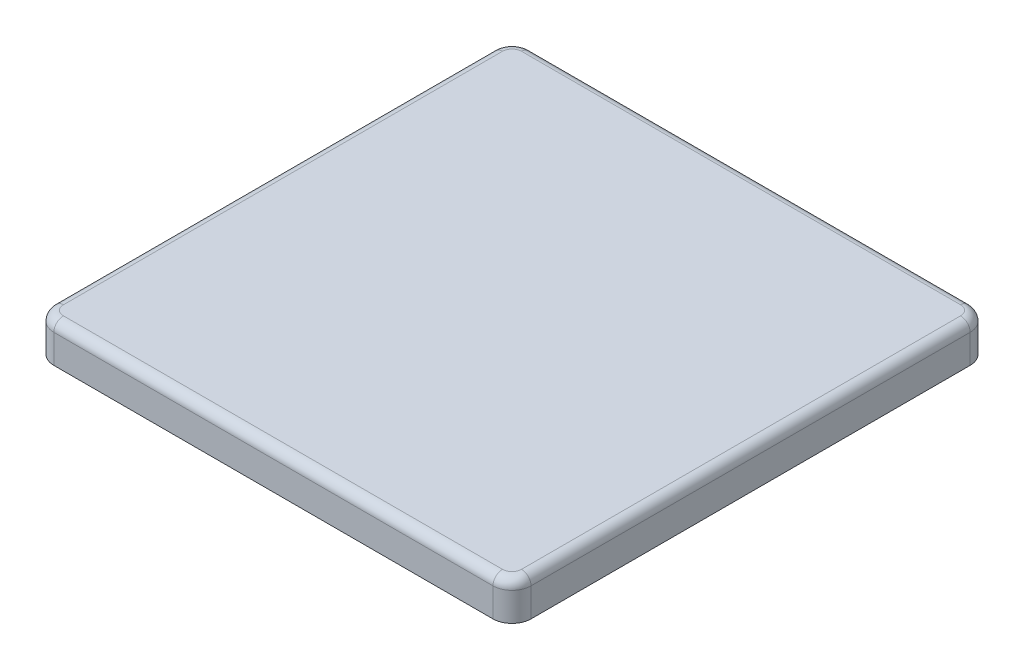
ISO-10303-21;
HEADER;
FILE_DESCRIPTION(('STEP AP214'),'2;1');
FILE_NAME('part.step','',(''),(''),'','','');
FILE_SCHEMA(('AUTOMOTIVE_DESIGN { 1 0 10303 214 1 1 1 1 }'));
ENDSEC;
DATA;
#1=APPLICATION_CONTEXT('core data for automotive mechanical design processes');
#2=APPLICATION_PROTOCOL_DEFINITION('international standard','automotive_design',2000,#1);
#3=PRODUCT_CONTEXT('',#1,'mechanical');
#4=PRODUCT('Part','Part','',(#3));
#5=PRODUCT_RELATED_PRODUCT_CATEGORY('part','',(#4));
#6=PRODUCT_DEFINITION_FORMATION('','',#4);
#7=PRODUCT_DEFINITION_CONTEXT('part definition',#1,'design');
#8=PRODUCT_DEFINITION('design','',#6,#7);
#9=PRODUCT_DEFINITION_SHAPE('','',#8);
#10=(LENGTH_UNIT() NAMED_UNIT(*) SI_UNIT(.MILLI.,.METRE.));
#11=(NAMED_UNIT(*) PLANE_ANGLE_UNIT() SI_UNIT($,.RADIAN.));
#12=(NAMED_UNIT(*) SI_UNIT($,.STERADIAN.) SOLID_ANGLE_UNIT());
#13=UNCERTAINTY_MEASURE_WITH_UNIT(LENGTH_MEASURE(1.E-05),#10,'distance_accuracy_value','');
#14=(GEOMETRIC_REPRESENTATION_CONTEXT(3) GLOBAL_UNCERTAINTY_ASSIGNED_CONTEXT((#13)) GLOBAL_UNIT_ASSIGNED_CONTEXT((#10,
#11,#12)) REPRESENTATION_CONTEXT('',''));
#15=CARTESIAN_POINT('',(0.,0.,0.));
#16=DIRECTION('',(0.,0.,1.));
#17=DIRECTION('',(1.,0.,0.));
#18=AXIS2_PLACEMENT_3D('',#15,#16,#17);
#19=CARTESIAN_POINT('',(-22.2,0.,22.2));
#20=DIRECTION('',(0.,-1.,0.));
#21=DIRECTION('',(0.,0.,-1.));
#22=AXIS2_PLACEMENT_3D('',#19,#20,#21);
#23=PLANE('',#22);
#24=DIRECTION('',(0.,0.,1.));
#25=VECTOR('',#24,1.);
#26=CARTESIAN_POINT('',(-21.2,0.,4.));
#27=LINE('',#26,#25);
#28=CARTESIAN_POINT('',(-21.2,0.,-4.));
#29=VERTEX_POINT('',#28);
#30=CARTESIAN_POINT('',(-21.2,0.,4.));
#31=VERTEX_POINT('',#30);
#32=EDGE_CURVE('E281',#29,#31,#27,.T.);
#33=ORIENTED_EDGE('',*,*,#32,.F.);
#34=DIRECTION('',(1.,0.,0.));
#35=VECTOR('',#34,1.);
#36=CARTESIAN_POINT('',(-23.,0.,-4.));
#37=LINE('',#36,#35);
#38=CARTESIAN_POINT('',(-23.,0.,-4.));
#39=VERTEX_POINT('',#38);
#40=EDGE_CURVE('E246',#39,#29,#37,.T.);
#41=ORIENTED_EDGE('',*,*,#40,.F.);
#42=DIRECTION('',(0.,0.,-1.));
#43=VECTOR('',#42,1.);
#44=CARTESIAN_POINT('',(-23.,0.,22.2));
#45=LINE('',#44,#43);
#46=CARTESIAN_POINT('',(-23.,0.,-22.2));
#47=VERTEX_POINT('',#46);
#48=EDGE_CURVE('E303',#39,#47,#45,.T.);
#49=ORIENTED_EDGE('',*,*,#48,.T.);
#50=CARTESIAN_POINT('',(-22.2,0.,-22.2));
#51=DIRECTION('',(0.,-1.,0.));
#52=DIRECTION('',(0.,0.,-1.));
#53=AXIS2_PLACEMENT_3D('',#50,#51,#52);
#54=CIRCLE('',#53,0.799999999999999);
#55=CARTESIAN_POINT('',(-22.2,0.,-23.));
#56=VERTEX_POINT('',#55);
#57=EDGE_CURVE('E308',#47,#56,#54,.T.);
#58=ORIENTED_EDGE('',*,*,#57,.T.);
#59=DIRECTION('',(1.,0.,0.));
#60=VECTOR('',#59,1.);
#61=CARTESIAN_POINT('',(-22.2,0.,-23.));
#62=LINE('',#61,#60);
#63=CARTESIAN_POINT('',(22.2,0.,-23.));
#64=VERTEX_POINT('',#63);
#65=EDGE_CURVE('E311',#56,#64,#62,.T.);
#66=ORIENTED_EDGE('',*,*,#65,.T.);
#67=CARTESIAN_POINT('',(22.2,0.,-22.2));
#68=DIRECTION('',(0.,-1.,0.));
#69=DIRECTION('',(0.,0.,-1.));
#70=AXIS2_PLACEMENT_3D('',#67,#68,#69);
#71=CIRCLE('',#70,0.799999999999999);
#72=CARTESIAN_POINT('',(23.,0.,-22.2));
#73=VERTEX_POINT('',#72);
#74=EDGE_CURVE('E314',#64,#73,#71,.T.);
#75=ORIENTED_EDGE('',*,*,#74,.T.);
#76=DIRECTION('',(0.,0.,1.));
#77=VECTOR('',#76,1.);
#78=CARTESIAN_POINT('',(23.,0.,22.2));
#79=LINE('',#78,#77);
#80=CARTESIAN_POINT('',(23.,0.,22.2));
#81=VERTEX_POINT('',#80);
#82=EDGE_CURVE('E317',#73,#81,#79,.T.);
#83=ORIENTED_EDGE('',*,*,#82,.T.);
#84=CARTESIAN_POINT('',(22.2,0.,22.2));
#85=DIRECTION('',(0.,-1.,0.));
#86=DIRECTION('',(0.,0.,-1.));
#87=AXIS2_PLACEMENT_3D('',#84,#85,#86);
#88=CIRCLE('',#87,0.799999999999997);
#89=CARTESIAN_POINT('',(22.2,0.,23.));
#90=VERTEX_POINT('',#89);
#91=EDGE_CURVE('E320',#81,#90,#88,.T.);
#92=ORIENTED_EDGE('',*,*,#91,.T.);
#93=DIRECTION('',(-1.,0.,0.));
#94=VECTOR('',#93,1.);
#95=CARTESIAN_POINT('',(-22.2,0.,23.));
#96=LINE('',#95,#94);
#97=CARTESIAN_POINT('',(-22.2,0.,23.));
#98=VERTEX_POINT('',#97);
#99=EDGE_CURVE('E323',#90,#98,#96,.T.);
#100=ORIENTED_EDGE('',*,*,#99,.T.);
#101=CARTESIAN_POINT('',(-22.2,0.,22.2));
#102=DIRECTION('',(0.,-1.,0.));
#103=DIRECTION('',(0.,0.,-1.));
#104=AXIS2_PLACEMENT_3D('',#101,#102,#103);
#105=CIRCLE('',#104,0.8);
#106=CARTESIAN_POINT('',(-23.,0.,22.2));
#107=VERTEX_POINT('',#106);
#108=EDGE_CURVE('E300',#98,#107,#105,.T.);
#109=ORIENTED_EDGE('',*,*,#108,.T.);
#110=CARTESIAN_POINT('',(-23.,0.,4.));
#111=VERTEX_POINT('',#110);
#112=EDGE_CURVE('E305',#107,#111,#45,.T.);
#113=ORIENTED_EDGE('',*,*,#112,.T.);
#114=DIRECTION('',(-1.,0.,0.));
#115=VECTOR('',#114,1.);
#116=CARTESIAN_POINT('',(-23.,0.,4.));
#117=LINE('',#116,#115);
#118=EDGE_CURVE('E273',#31,#111,#117,.T.);
#119=ORIENTED_EDGE('',*,*,#118,.F.);
#120=EDGE_LOOP('',(#33,#41,#49,#58,#66,#75,#83,#92,#100,#109,#113,#119));
#121=FACE_BOUND('',#120,.T.);
#122=DIRECTION('',(0.707106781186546,0.,0.707106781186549));
#123=VECTOR('',#122,1.);
#124=CARTESIAN_POINT('',(0.707106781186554,0.,-3.7476659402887));
#125=LINE('',#124,#123);
#126=CARTESIAN_POINT('',(0.707106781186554,0.,-3.7476659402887));
#127=VERTEX_POINT('',#126);
#128=CARTESIAN_POINT('',(3.7476659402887,0.,-0.70710678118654));
#129=VERTEX_POINT('',#128);
#130=EDGE_CURVE('E242',#127,#129,#125,.T.);
#131=ORIENTED_EDGE('',*,*,#130,.F.);
#132=DIRECTION('',(0.707106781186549,0.,-0.707106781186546));
#133=VECTOR('',#132,1.);
#134=CARTESIAN_POINT('',(-3.7476659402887,0.,0.707106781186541));
#135=LINE('',#134,#133);
#136=CARTESIAN_POINT('',(-3.7476659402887,0.,0.707106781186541));
#137=VERTEX_POINT('',#136);
#138=EDGE_CURVE('E250',#137,#127,#135,.T.);
#139=ORIENTED_EDGE('',*,*,#138,.F.);
#140=DIRECTION('',(-0.707106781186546,0.,-0.707106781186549));
#141=VECTOR('',#140,1.);
#142=CARTESIAN_POINT('',(-3.7476659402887,0.,0.707106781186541));
#143=LINE('',#142,#141);
#144=CARTESIAN_POINT('',(-0.707106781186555,0.,3.7476659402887));
#145=VERTEX_POINT('',#144);
#146=EDGE_CURVE('E261',#145,#137,#143,.T.);
#147=ORIENTED_EDGE('',*,*,#146,.F.);
#148=DIRECTION('',(-0.707106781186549,0.,0.707106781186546));
#149=VECTOR('',#148,1.);
#150=CARTESIAN_POINT('',(-0.707106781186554,0.,3.7476659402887));
#151=LINE('',#150,#149);
#152=EDGE_CURVE('E259',#129,#145,#151,.T.);
#153=ORIENTED_EDGE('',*,*,#152,.F.);
#154=EDGE_LOOP('',(#131,#139,#147,#153));
#155=FACE_BOUND('',#154,.T.);
#156=ADVANCED_FACE('F36',(#121,#155),#23,.T.);
#157=CARTESIAN_POINT('',(-23.,0.,22.2));
#158=DIRECTION('',(-1.,0.,0.));
#159=DIRECTION('',(0.,0.,1.));
#160=AXIS2_PLACEMENT_3D('',#157,#158,#159);
#161=PLANE('',#160);
#162=DIRECTION('',(0.,1.,0.));
#163=VECTOR('',#162,1.);
#164=CARTESIAN_POINT('',(-23.,-4.,-4.));
#165=LINE('',#164,#163);
#166=CARTESIAN_POINT('',(-23.,-2.,-4.));
#167=VERTEX_POINT('',#166);
#168=EDGE_CURVE('E293',#167,#39,#165,.T.);
#169=ORIENTED_EDGE('',*,*,#168,.F.);
#170=DIRECTION('',(0.,0.,-1.));
#171=VECTOR('',#170,1.);
#172=CARTESIAN_POINT('',(-23.,-2.,22.2));
#173=LINE('',#172,#171);
#174=CARTESIAN_POINT('',(-23.,-2.,-22.2));
#175=VERTEX_POINT('',#174);
#176=EDGE_CURVE('E328',#167,#175,#173,.T.);
#177=ORIENTED_EDGE('',*,*,#176,.T.);
#178=DIRECTION('',(0.,-1.,0.));
#179=VECTOR('',#178,1.);
#180=CARTESIAN_POINT('',(-23.,0.,-22.2));
#181=LINE('',#180,#179);
#182=EDGE_CURVE('E362',#47,#175,#181,.T.);
#183=ORIENTED_EDGE('',*,*,#182,.F.);
#184=ORIENTED_EDGE('',*,*,#48,.F.);
#185=EDGE_LOOP('',(#169,#177,#183,#184));
#186=FACE_BOUND('',#185,.T.);
#187=ADVANCED_FACE('F512',(#186),#161,.F.);
#188=DIRECTION('',(0.,1.,0.));
#189=VECTOR('',#188,1.);
#190=CARTESIAN_POINT('',(-23.,-4.,4.));
#191=LINE('',#190,#189);
#192=CARTESIAN_POINT('',(-23.,-2.,4.));
#193=VERTEX_POINT('',#192);
#194=EDGE_CURVE('E279',#193,#111,#191,.T.);
#195=ORIENTED_EDGE('',*,*,#194,.T.);
#196=ORIENTED_EDGE('',*,*,#112,.F.);
#197=DIRECTION('',(0.,-1.,0.));
#198=VECTOR('',#197,1.);
#199=CARTESIAN_POINT('',(-23.,0.,22.2));
#200=LINE('',#199,#198);
#201=CARTESIAN_POINT('',(-23.,-2.,22.2));
#202=VERTEX_POINT('',#201);
#203=EDGE_CURVE('E326',#107,#202,#200,.T.);
#204=ORIENTED_EDGE('',*,*,#203,.T.);
#205=EDGE_CURVE('E329',#202,#193,#173,.T.);
#206=ORIENTED_EDGE('',*,*,#205,.T.);
#207=EDGE_LOOP('',(#195,#196,#204,#206));
#208=FACE_BOUND('',#207,.T.);
#209=ADVANCED_FACE('F518',(#208),#161,.F.);
#210=CARTESIAN_POINT('',(-23.,2.,-23.));
#211=DIRECTION('',(0.,-1.,0.));
#212=DIRECTION('',(0.,0.,-1.));
#213=AXIS2_PLACEMENT_3D('',#210,#211,#212);
#214=CYLINDRICAL_SURFACE('',#213,2.);
#215=DIRECTION('',(0.,-1.,0.));
#216=VECTOR('',#215,1.);
#217=CARTESIAN_POINT('',(-25.,2.,-23.));
#218=LINE('',#217,#216);
#219=CARTESIAN_POINT('',(-25.,1.,-23.));
#220=VERTEX_POINT('',#219);
#221=CARTESIAN_POINT('',(-25.,-2.,-23.));
#222=VERTEX_POINT('',#221);
#223=EDGE_CURVE('E406',#220,#222,#218,.T.);
#224=ORIENTED_EDGE('',*,*,#223,.F.);
#225=CARTESIAN_POINT('',(-23.,1.,-23.));
#226=DIRECTION('',(0.,1.,0.));
#227=DIRECTION('',(0.,0.,1.));
#228=AXIS2_PLACEMENT_3D('',#225,#226,#227);
#229=CIRCLE('',#228,2.);
#230=CARTESIAN_POINT('',(-23.,1.,-25.));
#231=VERTEX_POINT('',#230);
#232=EDGE_CURVE('E430',#220,#231,#229,.F.);
#233=ORIENTED_EDGE('',*,*,#232,.T.);
#234=DIRECTION('',(0.,-1.,0.));
#235=VECTOR('',#234,1.);
#236=CARTESIAN_POINT('',(-23.,2.,-25.));
#237=LINE('',#236,#235);
#238=CARTESIAN_POINT('',(-23.,-2.,-25.));
#239=VERTEX_POINT('',#238);
#240=EDGE_CURVE('E392',#231,#239,#237,.T.);
#241=ORIENTED_EDGE('',*,*,#240,.T.);
#242=CARTESIAN_POINT('',(-23.,-2.,-23.));
#243=DIRECTION('',(0.,1.,0.));
#244=DIRECTION('',(0.,0.,1.));
#245=AXIS2_PLACEMENT_3D('',#242,#243,#244);
#246=CIRCLE('',#245,2.);
#247=EDGE_CURVE('E367',#239,#222,#246,.T.);
#248=ORIENTED_EDGE('',*,*,#247,.T.);
#249=EDGE_LOOP('',(#224,#233,#241,#248));
#250=FACE_BOUND('',#249,.T.);
#251=ADVANCED_FACE('F591',(#250),#214,.T.);
#252=CARTESIAN_POINT('',(-25.,2.,23.));
#253=DIRECTION('',(1.,0.,0.));
#254=DIRECTION('',(0.,0.,-1.));
#255=AXIS2_PLACEMENT_3D('',#252,#253,#254);
#256=PLANE('',#255);
#257=DIRECTION('',(0.,-1.,0.));
#258=VECTOR('',#257,1.);
#259=CARTESIAN_POINT('',(-25.,2.,23.));
#260=LINE('',#259,#258);
#261=CARTESIAN_POINT('',(-25.,1.,23.));
#262=VERTEX_POINT('',#261);
#263=CARTESIAN_POINT('',(-25.,-2.,23.));
#264=VERTEX_POINT('',#263);
#265=EDGE_CURVE('E404',#262,#264,#260,.T.);
#266=ORIENTED_EDGE('',*,*,#265,.F.);
#267=DIRECTION('',(0.,0.,1.));
#268=VECTOR('',#267,1.);
#269=CARTESIAN_POINT('',(-25.,1.,-23.));
#270=LINE('',#269,#268);
#271=EDGE_CURVE('E428',#262,#220,#270,.F.);
#272=ORIENTED_EDGE('',*,*,#271,.T.);
#273=ORIENTED_EDGE('',*,*,#223,.T.);
#274=DIRECTION('',(0.,0.,1.));
#275=VECTOR('',#274,1.);
#276=CARTESIAN_POINT('',(-25.,-2.,23.));
#277=LINE('',#276,#275);
#278=EDGE_CURVE('E370',#222,#264,#277,.T.);
#279=ORIENTED_EDGE('',*,*,#278,.T.);
#280=EDGE_LOOP('',(#266,#272,#273,#279));
#281=FACE_BOUND('',#280,.T.);
#282=ADVANCED_FACE('F587',(#281),#256,.F.);
#283=CARTESIAN_POINT('',(-23.,2.,23.));
#284=DIRECTION('',(0.,-1.,0.));
#285=DIRECTION('',(0.,0.,-1.));
#286=AXIS2_PLACEMENT_3D('',#283,#284,#285);
#287=CYLINDRICAL_SURFACE('',#286,2.);
#288=DIRECTION('',(0.,-1.,0.));
#289=VECTOR('',#288,1.);
#290=CARTESIAN_POINT('',(-23.,2.,25.));
#291=LINE('',#290,#289);
#292=CARTESIAN_POINT('',(-23.,1.,25.));
#293=VERTEX_POINT('',#292);
#294=CARTESIAN_POINT('',(-23.,-2.,25.));
#295=VERTEX_POINT('',#294);
#296=EDGE_CURVE('E402',#293,#295,#291,.T.);
#297=ORIENTED_EDGE('',*,*,#296,.F.);
#298=CARTESIAN_POINT('',(-23.,1.,23.));
#299=DIRECTION('',(0.,1.,0.));
#300=DIRECTION('',(0.,0.,1.));
#301=AXIS2_PLACEMENT_3D('',#298,#299,#300);
#302=CIRCLE('',#301,2.);
#303=EDGE_CURVE('E425',#293,#262,#302,.F.);
#304=ORIENTED_EDGE('',*,*,#303,.T.);
#305=ORIENTED_EDGE('',*,*,#265,.T.);
#306=CARTESIAN_POINT('',(-23.,-2.,23.));
#307=DIRECTION('',(0.,1.,0.));
#308=DIRECTION('',(0.,0.,1.));
#309=AXIS2_PLACEMENT_3D('',#306,#307,#308);
#310=CIRCLE('',#309,2.);
#311=EDGE_CURVE('E374',#264,#295,#310,.T.);
#312=ORIENTED_EDGE('',*,*,#311,.T.);
#313=EDGE_LOOP('',(#297,#304,#305,#312));
#314=FACE_BOUND('',#313,.T.);
#315=ADVANCED_FACE('F583',(#314),#287,.T.);
#316=CARTESIAN_POINT('',(-23.,2.,25.));
#317=DIRECTION('',(0.,0.,-1.));
#318=DIRECTION('',(-1.,0.,0.));
#319=AXIS2_PLACEMENT_3D('',#316,#317,#318);
#320=PLANE('',#319);
#321=DIRECTION('',(0.,-1.,0.));
#322=VECTOR('',#321,1.);
#323=CARTESIAN_POINT('',(23.,2.,25.));
#324=LINE('',#323,#322);
#325=CARTESIAN_POINT('',(23.,1.,25.));
#326=VERTEX_POINT('',#325);
#327=CARTESIAN_POINT('',(23.,-2.,25.));
#328=VERTEX_POINT('',#327);
#329=EDGE_CURVE('E400',#326,#328,#324,.T.);
#330=ORIENTED_EDGE('',*,*,#329,.F.);
#331=DIRECTION('',(1.,0.,0.));
#332=VECTOR('',#331,1.);
#333=CARTESIAN_POINT('',(-23.,1.,25.));
#334=LINE('',#333,#332);
#335=EDGE_CURVE('E440',#326,#293,#334,.F.);
#336=ORIENTED_EDGE('',*,*,#335,.T.);
#337=ORIENTED_EDGE('',*,*,#296,.T.);
#338=DIRECTION('',(1.,0.,0.));
#339=VECTOR('',#338,1.);
#340=CARTESIAN_POINT('',(-23.,-2.,25.));
#341=LINE('',#340,#339);
#342=EDGE_CURVE('E377',#295,#328,#341,.T.);
#343=ORIENTED_EDGE('',*,*,#342,.T.);
#344=EDGE_LOOP('',(#330,#336,#337,#343));
#345=FACE_BOUND('',#344,.T.);
#346=ADVANCED_FACE('F579',(#345),#320,.F.);
#347=CARTESIAN_POINT('',(23.,2.,23.));
#348=DIRECTION('',(0.,-1.,0.));
#349=DIRECTION('',(0.,0.,-1.));
#350=AXIS2_PLACEMENT_3D('',#347,#348,#349);
#351=CYLINDRICAL_SURFACE('',#350,2.);
#352=DIRECTION('',(0.,-1.,0.));
#353=VECTOR('',#352,1.);
#354=CARTESIAN_POINT('',(25.,2.,23.));
#355=LINE('',#354,#353);
#356=CARTESIAN_POINT('',(25.,1.,23.));
#357=VERTEX_POINT('',#356);
#358=CARTESIAN_POINT('',(25.,-2.,23.));
#359=VERTEX_POINT('',#358);
#360=EDGE_CURVE('E398',#357,#359,#355,.T.);
#361=ORIENTED_EDGE('',*,*,#360,.F.);
#362=CARTESIAN_POINT('',(23.,1.,23.));
#363=DIRECTION('',(0.,1.,0.));
#364=DIRECTION('',(0.,0.,1.));
#365=AXIS2_PLACEMENT_3D('',#362,#363,#364);
#366=CIRCLE('',#365,2.);
#367=EDGE_CURVE('E438',#357,#326,#366,.F.);
#368=ORIENTED_EDGE('',*,*,#367,.T.);
#369=ORIENTED_EDGE('',*,*,#329,.T.);
#370=CARTESIAN_POINT('',(23.,-2.,23.));
#371=DIRECTION('',(0.,1.,0.));
#372=DIRECTION('',(0.,0.,1.));
#373=AXIS2_PLACEMENT_3D('',#370,#371,#372);
#374=CIRCLE('',#373,2.);
#375=EDGE_CURVE('E380',#328,#359,#374,.T.);
#376=ORIENTED_EDGE('',*,*,#375,.T.);
#377=EDGE_LOOP('',(#361,#368,#369,#376));
#378=FACE_BOUND('',#377,.T.);
#379=ADVANCED_FACE('F575',(#378),#351,.T.);
#380=CARTESIAN_POINT('',(25.,2.,23.));
#381=DIRECTION('',(-1.,0.,0.));
#382=DIRECTION('',(0.,0.,1.));
#383=AXIS2_PLACEMENT_3D('',#380,#381,#382);
#384=PLANE('',#383);
#385=DIRECTION('',(0.,-1.,0.));
#386=VECTOR('',#385,1.);
#387=CARTESIAN_POINT('',(25.,2.,-23.));
#388=LINE('',#387,#386);
#389=CARTESIAN_POINT('',(25.,1.,-23.));
#390=VERTEX_POINT('',#389);
#391=CARTESIAN_POINT('',(25.,-2.,-23.));
#392=VERTEX_POINT('',#391);
#393=EDGE_CURVE('E396',#390,#392,#388,.T.);
#394=ORIENTED_EDGE('',*,*,#393,.F.);
#395=DIRECTION('',(0.,0.,-1.));
#396=VECTOR('',#395,1.);
#397=CARTESIAN_POINT('',(25.,1.,23.));
#398=LINE('',#397,#396);
#399=EDGE_CURVE('E436',#390,#357,#398,.F.);
#400=ORIENTED_EDGE('',*,*,#399,.T.);
#401=ORIENTED_EDGE('',*,*,#360,.T.);
#402=DIRECTION('',(0.,0.,-1.));
#403=VECTOR('',#402,1.);
#404=CARTESIAN_POINT('',(25.,-2.,23.));
#405=LINE('',#404,#403);
#406=EDGE_CURVE('E383',#359,#392,#405,.T.);
#407=ORIENTED_EDGE('',*,*,#406,.T.);
#408=EDGE_LOOP('',(#394,#400,#401,#407));
#409=FACE_BOUND('',#408,.T.);
#410=ADVANCED_FACE('F571',(#409),#384,.F.);
#411=CARTESIAN_POINT('',(23.,2.,-23.));
#412=DIRECTION('',(0.,-1.,0.));
#413=DIRECTION('',(0.,0.,-1.));
#414=AXIS2_PLACEMENT_3D('',#411,#412,#413);
#415=CYLINDRICAL_SURFACE('',#414,2.);
#416=DIRECTION('',(0.,-1.,0.));
#417=VECTOR('',#416,1.);
#418=CARTESIAN_POINT('',(23.,2.,-25.));
#419=LINE('',#418,#417);
#420=CARTESIAN_POINT('',(23.,1.,-25.));
#421=VERTEX_POINT('',#420);
#422=CARTESIAN_POINT('',(23.,-2.,-25.));
#423=VERTEX_POINT('',#422);
#424=EDGE_CURVE('E394',#421,#423,#419,.T.);
#425=ORIENTED_EDGE('',*,*,#424,.F.);
#426=CARTESIAN_POINT('',(23.,1.,-23.));
#427=DIRECTION('',(0.,1.,0.));
#428=DIRECTION('',(0.,0.,1.));
#429=AXIS2_PLACEMENT_3D('',#426,#427,#428);
#430=CIRCLE('',#429,2.);
#431=EDGE_CURVE('E434',#421,#390,#430,.F.);
#432=ORIENTED_EDGE('',*,*,#431,.T.);
#433=ORIENTED_EDGE('',*,*,#393,.T.);
#434=CARTESIAN_POINT('',(23.,-2.,-23.));
#435=DIRECTION('',(0.,1.,0.));
#436=DIRECTION('',(0.,0.,1.));
#437=AXIS2_PLACEMENT_3D('',#434,#435,#436);
#438=CIRCLE('',#437,2.);
#439=EDGE_CURVE('E386',#392,#423,#438,.T.);
#440=ORIENTED_EDGE('',*,*,#439,.T.);
#441=EDGE_LOOP('',(#425,#432,#433,#440));
#442=FACE_BOUND('',#441,.T.);
#443=ADVANCED_FACE('F567',(#442),#415,.T.);
#444=CARTESIAN_POINT('',(-23.,2.,-25.));
#445=DIRECTION('',(0.,0.,1.));
#446=DIRECTION('',(1.,0.,0.));
#447=AXIS2_PLACEMENT_3D('',#444,#445,#446);
#448=PLANE('',#447);
#449=ORIENTED_EDGE('',*,*,#240,.F.);
#450=DIRECTION('',(-1.,0.,0.));
#451=VECTOR('',#450,1.);
#452=CARTESIAN_POINT('',(23.,1.,-25.));
#453=LINE('',#452,#451);
#454=EDGE_CURVE('E432',#231,#421,#453,.F.);
#455=ORIENTED_EDGE('',*,*,#454,.T.);
#456=ORIENTED_EDGE('',*,*,#424,.T.);
#457=DIRECTION('',(-1.,0.,0.));
#458=VECTOR('',#457,1.);
#459=CARTESIAN_POINT('',(-23.,-2.,-25.));
#460=LINE('',#459,#458);
#461=EDGE_CURVE('E389',#423,#239,#460,.T.);
#462=ORIENTED_EDGE('',*,*,#461,.T.);
#463=EDGE_LOOP('',(#449,#455,#456,#462));
#464=FACE_BOUND('',#463,.T.);
#465=ADVANCED_FACE('F559',(#464),#448,.F.);
#466=CARTESIAN_POINT('',(-23.,2.,-23.));
#467=DIRECTION('',(0.,1.,0.));
#468=DIRECTION('',(0.,0.,1.));
#469=AXIS2_PLACEMENT_3D('',#466,#467,#468);
#470=PLANE('',#469);
#471=DIRECTION('',(0.,0.,1.));
#472=VECTOR('',#471,1.);
#473=CARTESIAN_POINT('',(-24.,2.,23.));
#474=LINE('',#473,#472);
#475=CARTESIAN_POINT('',(-24.,2.,-23.));
#476=VERTEX_POINT('',#475);
#477=CARTESIAN_POINT('',(-24.,2.,23.));
#478=VERTEX_POINT('',#477);
#479=EDGE_CURVE('E420',#476,#478,#474,.T.);
#480=ORIENTED_EDGE('',*,*,#479,.T.);
#481=CARTESIAN_POINT('',(-23.,2.,23.));
#482=DIRECTION('',(0.,1.,0.));
#483=DIRECTION('',(0.,0.,1.));
#484=AXIS2_PLACEMENT_3D('',#481,#482,#483);
#485=CIRCLE('',#484,1.);
#486=CARTESIAN_POINT('',(-23.,2.,24.));
#487=VERTEX_POINT('',#486);
#488=EDGE_CURVE('E422',#478,#487,#485,.T.);
#489=ORIENTED_EDGE('',*,*,#488,.T.);
#490=DIRECTION('',(1.,0.,0.));
#491=VECTOR('',#490,1.);
#492=CARTESIAN_POINT('',(23.,2.,24.));
#493=LINE('',#492,#491);
#494=CARTESIAN_POINT('',(23.,2.,24.));
#495=VERTEX_POINT('',#494);
#496=EDGE_CURVE('E408',#487,#495,#493,.T.);
#497=ORIENTED_EDGE('',*,*,#496,.T.);
#498=CARTESIAN_POINT('',(23.,2.,23.));
#499=DIRECTION('',(0.,1.,0.));
#500=DIRECTION('',(0.,0.,1.));
#501=AXIS2_PLACEMENT_3D('',#498,#499,#500);
#502=CIRCLE('',#501,0.999999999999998);
#503=CARTESIAN_POINT('',(24.,2.,23.));
#504=VERTEX_POINT('',#503);
#505=EDGE_CURVE('E410',#495,#504,#502,.T.);
#506=ORIENTED_EDGE('',*,*,#505,.T.);
#507=DIRECTION('',(0.,0.,-1.));
#508=VECTOR('',#507,1.);
#509=CARTESIAN_POINT('',(24.,2.,-23.));
#510=LINE('',#509,#508);
#511=CARTESIAN_POINT('',(24.,2.,-23.));
#512=VERTEX_POINT('',#511);
#513=EDGE_CURVE('E412',#504,#512,#510,.T.);
#514=ORIENTED_EDGE('',*,*,#513,.T.);
#515=CARTESIAN_POINT('',(23.,2.,-23.));
#516=DIRECTION('',(0.,1.,0.));
#517=DIRECTION('',(0.,0.,1.));
#518=AXIS2_PLACEMENT_3D('',#515,#516,#517);
#519=CIRCLE('',#518,0.999999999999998);
#520=CARTESIAN_POINT('',(23.,2.,-24.));
#521=VERTEX_POINT('',#520);
#522=EDGE_CURVE('E414',#512,#521,#519,.T.);
#523=ORIENTED_EDGE('',*,*,#522,.T.);
#524=DIRECTION('',(-1.,0.,0.));
#525=VECTOR('',#524,1.);
#526=CARTESIAN_POINT('',(-23.,2.,-24.));
#527=LINE('',#526,#525);
#528=CARTESIAN_POINT('',(-23.,2.,-24.));
#529=VERTEX_POINT('',#528);
#530=EDGE_CURVE('E416',#521,#529,#527,.T.);
#531=ORIENTED_EDGE('',*,*,#530,.T.);
#532=CARTESIAN_POINT('',(-23.,2.,-23.));
#533=DIRECTION('',(0.,1.,0.));
#534=DIRECTION('',(0.,0.,1.));
#535=AXIS2_PLACEMENT_3D('',#532,#533,#534);
#536=CIRCLE('',#535,1.);
#537=EDGE_CURVE('E418',#529,#476,#536,.T.);
#538=ORIENTED_EDGE('',*,*,#537,.T.);
#539=EDGE_LOOP('',(#480,#489,#497,#506,#514,#523,#531,#538));
#540=FACE_BOUND('',#539,.T.);
#541=ADVANCED_FACE('F555',(#540),#470,.T.);
#542=CARTESIAN_POINT('',(-23.,-2.,-23.));
#543=DIRECTION('',(0.,1.,0.));
#544=DIRECTION('',(0.,0.,1.));
#545=AXIS2_PLACEMENT_3D('',#542,#543,#544);
#546=PLANE('',#545);
#547=ORIENTED_EDGE('',*,*,#205,.F.);
#548=CARTESIAN_POINT('',(-22.2,-2.,22.2));
#549=DIRECTION('',(0.,-1.,0.));
#550=DIRECTION('',(0.,0.,-1.));
#551=AXIS2_PLACEMENT_3D('',#548,#549,#550);
#552=CIRCLE('',#551,0.8);
#553=CARTESIAN_POINT('',(-22.2,-2.,23.));
#554=VERTEX_POINT('',#553);
#555=EDGE_CURVE('E299',#554,#202,#552,.T.);
#556=ORIENTED_EDGE('',*,*,#555,.F.);
#557=DIRECTION('',(-1.,0.,0.));
#558=VECTOR('',#557,1.);
#559=CARTESIAN_POINT('',(-22.2,-2.,23.));
#560=LINE('',#559,#558);
#561=CARTESIAN_POINT('',(22.2,-2.,23.));
#562=VERTEX_POINT('',#561);
#563=EDGE_CURVE('E304',#562,#554,#560,.T.);
#564=ORIENTED_EDGE('',*,*,#563,.F.);
#565=CARTESIAN_POINT('',(22.2,-2.,22.2));
#566=DIRECTION('',(0.,-1.,0.));
#567=DIRECTION('',(0.,0.,-1.));
#568=AXIS2_PLACEMENT_3D('',#565,#566,#567);
#569=CIRCLE('',#568,0.799999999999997);
#570=CARTESIAN_POINT('',(23.,-2.,22.2));
#571=VERTEX_POINT('',#570);
#572=EDGE_CURVE('E344',#571,#562,#569,.T.);
#573=ORIENTED_EDGE('',*,*,#572,.F.);
#574=DIRECTION('',(0.,0.,1.));
#575=VECTOR('',#574,1.);
#576=CARTESIAN_POINT('',(23.,-2.,22.2));
#577=LINE('',#576,#575);
#578=CARTESIAN_POINT('',(23.,-2.,-22.2));
#579=VERTEX_POINT('',#578);
#580=EDGE_CURVE('E341',#579,#571,#577,.T.);
#581=ORIENTED_EDGE('',*,*,#580,.F.);
#582=CARTESIAN_POINT('',(22.2,-2.,-22.2));
#583=DIRECTION('',(0.,-1.,0.));
#584=DIRECTION('',(0.,0.,-1.));
#585=AXIS2_PLACEMENT_3D('',#582,#583,#584);
#586=CIRCLE('',#585,0.799999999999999);
#587=CARTESIAN_POINT('',(22.2,-2.,-23.));
#588=VERTEX_POINT('',#587);
#589=EDGE_CURVE('E338',#588,#579,#586,.T.);
#590=ORIENTED_EDGE('',*,*,#589,.F.);
#591=DIRECTION('',(1.,0.,0.));
#592=VECTOR('',#591,1.);
#593=CARTESIAN_POINT('',(-22.2,-2.,-23.));
#594=LINE('',#593,#592);
#595=CARTESIAN_POINT('',(-22.2,-2.,-23.));
#596=VERTEX_POINT('',#595);
#597=EDGE_CURVE('E335',#596,#588,#594,.T.);
#598=ORIENTED_EDGE('',*,*,#597,.F.);
#599=CARTESIAN_POINT('',(-22.2,-2.,-22.2));
#600=DIRECTION('',(0.,-1.,0.));
#601=DIRECTION('',(0.,0.,-1.));
#602=AXIS2_PLACEMENT_3D('',#599,#600,#601);
#603=CIRCLE('',#602,0.799999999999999);
#604=EDGE_CURVE('E332',#175,#596,#603,.T.);
#605=ORIENTED_EDGE('',*,*,#604,.F.);
#606=ORIENTED_EDGE('',*,*,#176,.F.);
#607=DIRECTION('',(0.,0.,-1.));
#608=VECTOR('',#607,1.);
#609=CARTESIAN_POINT('',(-23.,-2.,-23.));
#610=LINE('',#609,#608);
#611=EDGE_CURVE('E297',#193,#167,#610,.T.);
#612=ORIENTED_EDGE('',*,*,#611,.F.);
#613=EDGE_LOOP('',(#547,#556,#564,#573,#581,#590,#598,#605,#606,#612));
#614=FACE_BOUND('',#613,.T.);
#615=ORIENTED_EDGE('',*,*,#247,.F.);
#616=ORIENTED_EDGE('',*,*,#461,.F.);
#617=ORIENTED_EDGE('',*,*,#439,.F.);
#618=ORIENTED_EDGE('',*,*,#406,.F.);
#619=ORIENTED_EDGE('',*,*,#375,.F.);
#620=ORIENTED_EDGE('',*,*,#342,.F.);
#621=ORIENTED_EDGE('',*,*,#311,.F.);
#622=ORIENTED_EDGE('',*,*,#278,.F.);
#623=EDGE_LOOP('',(#615,#616,#617,#618,#619,#620,#621,#622));
#624=FACE_BOUND('',#623,.T.);
#625=ADVANCED_FACE('F558',(#614,#624),#546,.F.);
#626=CARTESIAN_POINT('',(23.,1.,-23.));
#627=DIRECTION('',(0.,1.,0.));
#628=DIRECTION('',(0.,0.,1.));
#629=AXIS2_PLACEMENT_3D('',#626,#627,#628);
#630=DEGENERATE_TOROIDAL_SURFACE('',#629,0.999999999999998,1.,.T.);
#631=CARTESIAN_POINT('',(24.,1.,-23.));
#632=DIRECTION('',(0.,0.,1.));
#633=DIRECTION('',(1.,0.,0.));
#634=AXIS2_PLACEMENT_3D('',#631,#632,#633);
#635=CIRCLE('',#634,1.);
#636=EDGE_CURVE('E458',#390,#512,#635,.T.);
#637=ORIENTED_EDGE('',*,*,#636,.F.);
#638=ORIENTED_EDGE('',*,*,#431,.F.);
#639=CARTESIAN_POINT('',(23.,1.,-24.));
#640=DIRECTION('',(-1.,0.,0.));
#641=DIRECTION('',(0.,0.,1.));
#642=AXIS2_PLACEMENT_3D('',#639,#640,#641);
#643=CIRCLE('',#642,1.);
#644=EDGE_CURVE('E371',#521,#421,#643,.T.);
#645=ORIENTED_EDGE('',*,*,#644,.F.);
#646=ORIENTED_EDGE('',*,*,#522,.F.);
#647=EDGE_LOOP('',(#637,#638,#645,#646));
#648=FACE_BOUND('',#647,.T.);
#649=ADVANCED_FACE('F563',(#648),#630,.T.);
#650=CARTESIAN_POINT('',(-23.,1.,-24.));
#651=DIRECTION('',(1.,0.,0.));
#652=DIRECTION('',(0.,0.,-1.));
#653=AXIS2_PLACEMENT_3D('',#650,#651,#652);
#654=CYLINDRICAL_SURFACE('',#653,1.);
#655=ORIENTED_EDGE('',*,*,#644,.T.);
#656=ORIENTED_EDGE('',*,*,#454,.F.);
#657=CARTESIAN_POINT('',(-23.,1.,-24.));
#658=DIRECTION('',(-1.,0.,0.));
#659=DIRECTION('',(0.,0.,1.));
#660=AXIS2_PLACEMENT_3D('',#657,#658,#659);
#661=CIRCLE('',#660,1.);
#662=EDGE_CURVE('E455',#529,#231,#661,.T.);
#663=ORIENTED_EDGE('',*,*,#662,.F.);
#664=ORIENTED_EDGE('',*,*,#530,.F.);
#665=EDGE_LOOP('',(#655,#656,#663,#664));
#666=FACE_BOUND('',#665,.T.);
#667=ADVANCED_FACE('F618',(#666),#654,.T.);
#668=CARTESIAN_POINT('',(24.,1.,-23.));
#669=DIRECTION('',(0.,0.,1.));
#670=DIRECTION('',(1.,0.,0.));
#671=AXIS2_PLACEMENT_3D('',#668,#669,#670);
#672=CYLINDRICAL_SURFACE('',#671,1.);
#673=ORIENTED_EDGE('',*,*,#636,.T.);
#674=ORIENTED_EDGE('',*,*,#513,.F.);
#675=CARTESIAN_POINT('',(24.,1.,23.));
#676=DIRECTION('',(0.,0.,1.));
#677=DIRECTION('',(1.,0.,0.));
#678=AXIS2_PLACEMENT_3D('',#675,#676,#677);
#679=CIRCLE('',#678,1.);
#680=EDGE_CURVE('E452',#357,#504,#679,.T.);
#681=ORIENTED_EDGE('',*,*,#680,.F.);
#682=ORIENTED_EDGE('',*,*,#399,.F.);
#683=EDGE_LOOP('',(#673,#674,#681,#682));
#684=FACE_BOUND('',#683,.T.);
#685=ADVANCED_FACE('F614',(#684),#672,.T.);
#686=CARTESIAN_POINT('',(-23.,1.,-23.));
#687=DIRECTION('',(0.,1.,0.));
#688=DIRECTION('',(0.,0.,1.));
#689=AXIS2_PLACEMENT_3D('',#686,#687,#688);
#690=TOROIDAL_SURFACE('',#689,1.,1.);
#691=ORIENTED_EDGE('',*,*,#662,.T.);
#692=ORIENTED_EDGE('',*,*,#232,.F.);
#693=CARTESIAN_POINT('',(-24.,1.,-23.));
#694=DIRECTION('',(0.,0.,1.));
#695=DIRECTION('',(1.,0.,0.));
#696=AXIS2_PLACEMENT_3D('',#693,#694,#695);
#697=CIRCLE('',#696,1.);
#698=EDGE_CURVE('E449',#476,#220,#697,.T.);
#699=ORIENTED_EDGE('',*,*,#698,.F.);
#700=ORIENTED_EDGE('',*,*,#537,.F.);
#701=EDGE_LOOP('',(#691,#692,#699,#700));
#702=FACE_BOUND('',#701,.T.);
#703=ADVANCED_FACE('F610',(#702),#690,.T.);
#704=CARTESIAN_POINT('',(23.,1.,23.));
#705=DIRECTION('',(0.,1.,0.));
#706=DIRECTION('',(0.,0.,1.));
#707=AXIS2_PLACEMENT_3D('',#704,#705,#706);
#708=DEGENERATE_TOROIDAL_SURFACE('',#707,0.999999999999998,1.,.T.);
#709=ORIENTED_EDGE('',*,*,#680,.T.);
#710=ORIENTED_EDGE('',*,*,#505,.F.);
#711=CARTESIAN_POINT('',(23.,1.,24.));
#712=DIRECTION('',(-1.,0.,0.));
#713=DIRECTION('',(0.,0.,1.));
#714=AXIS2_PLACEMENT_3D('',#711,#712,#713);
#715=CIRCLE('',#714,1.);
#716=EDGE_CURVE('E446',#326,#495,#715,.T.);
#717=ORIENTED_EDGE('',*,*,#716,.F.);
#718=ORIENTED_EDGE('',*,*,#367,.F.);
#719=EDGE_LOOP('',(#709,#710,#717,#718));
#720=FACE_BOUND('',#719,.T.);
#721=ADVANCED_FACE('F606',(#720),#708,.T.);
#722=CARTESIAN_POINT('',(-24.,1.,-23.));
#723=DIRECTION('',(0.,0.,-1.));
#724=DIRECTION('',(-1.,0.,0.));
#725=AXIS2_PLACEMENT_3D('',#722,#723,#724);
#726=CYLINDRICAL_SURFACE('',#725,1.);
#727=ORIENTED_EDGE('',*,*,#698,.T.);
#728=ORIENTED_EDGE('',*,*,#271,.F.);
#729=CARTESIAN_POINT('',(-24.,1.,23.));
#730=DIRECTION('',(0.,0.,1.));
#731=DIRECTION('',(1.,0.,0.));
#732=AXIS2_PLACEMENT_3D('',#729,#730,#731);
#733=CIRCLE('',#732,1.);
#734=EDGE_CURVE('E444',#478,#262,#733,.T.);
#735=ORIENTED_EDGE('',*,*,#734,.F.);
#736=ORIENTED_EDGE('',*,*,#479,.F.);
#737=EDGE_LOOP('',(#727,#728,#735,#736));
#738=FACE_BOUND('',#737,.T.);
#739=ADVANCED_FACE('F602',(#738),#726,.T.);
#740=CARTESIAN_POINT('',(-23.,1.,24.));
#741=DIRECTION('',(-1.,0.,0.));
#742=DIRECTION('',(0.,0.,1.));
#743=AXIS2_PLACEMENT_3D('',#740,#741,#742);
#744=CYLINDRICAL_SURFACE('',#743,1.);
#745=ORIENTED_EDGE('',*,*,#716,.T.);
#746=ORIENTED_EDGE('',*,*,#496,.F.);
#747=CARTESIAN_POINT('',(-23.,1.,24.));
#748=DIRECTION('',(-1.,0.,0.));
#749=DIRECTION('',(0.,0.,1.));
#750=AXIS2_PLACEMENT_3D('',#747,#748,#749);
#751=CIRCLE('',#750,1.);
#752=EDGE_CURVE('E351',#293,#487,#751,.T.);
#753=ORIENTED_EDGE('',*,*,#752,.F.);
#754=ORIENTED_EDGE('',*,*,#335,.F.);
#755=EDGE_LOOP('',(#745,#746,#753,#754));
#756=FACE_BOUND('',#755,.T.);
#757=ADVANCED_FACE('F598',(#756),#744,.T.);
#758=CARTESIAN_POINT('',(-23.,1.,23.));
#759=DIRECTION('',(0.,1.,0.));
#760=DIRECTION('',(0.,0.,1.));
#761=AXIS2_PLACEMENT_3D('',#758,#759,#760);
#762=TOROIDAL_SURFACE('',#761,1.,1.);
#763=ORIENTED_EDGE('',*,*,#734,.T.);
#764=ORIENTED_EDGE('',*,*,#303,.F.);
#765=ORIENTED_EDGE('',*,*,#752,.T.);
#766=ORIENTED_EDGE('',*,*,#488,.F.);
#767=EDGE_LOOP('',(#763,#764,#765,#766));
#768=FACE_BOUND('',#767,.T.);
#769=ADVANCED_FACE('F553',(#768),#762,.T.);
#770=CARTESIAN_POINT('',(-22.2,0.,22.2));
#771=DIRECTION('',(0.,-1.,0.));
#772=DIRECTION('',(0.,0.,-1.));
#773=AXIS2_PLACEMENT_3D('',#770,#771,#772);
#774=CYLINDRICAL_SURFACE('',#773,0.8);
#775=ORIENTED_EDGE('',*,*,#555,.T.);
#776=ORIENTED_EDGE('',*,*,#203,.F.);
#777=ORIENTED_EDGE('',*,*,#108,.F.);
#778=DIRECTION('',(0.,-1.,0.));
#779=VECTOR('',#778,1.);
#780=CARTESIAN_POINT('',(-22.2,0.,23.));
#781=LINE('',#780,#779);
#782=EDGE_CURVE('E349',#98,#554,#781,.T.);
#783=ORIENTED_EDGE('',*,*,#782,.T.);
#784=EDGE_LOOP('',(#775,#776,#777,#783));
#785=FACE_BOUND('',#784,.T.);
#786=ADVANCED_FACE('F530',(#785),#774,.F.);
#787=CARTESIAN_POINT('',(-22.2,0.,23.));
#788=DIRECTION('',(0.,0.,1.));
#789=DIRECTION('',(1.,0.,0.));
#790=AXIS2_PLACEMENT_3D('',#787,#788,#789);
#791=PLANE('',#790);
#792=ORIENTED_EDGE('',*,*,#563,.T.);
#793=ORIENTED_EDGE('',*,*,#782,.F.);
#794=ORIENTED_EDGE('',*,*,#99,.F.);
#795=DIRECTION('',(0.,-1.,0.));
#796=VECTOR('',#795,1.);
#797=CARTESIAN_POINT('',(22.2,0.,23.));
#798=LINE('',#797,#796);
#799=EDGE_CURVE('E352',#90,#562,#798,.T.);
#800=ORIENTED_EDGE('',*,*,#799,.T.);
#801=EDGE_LOOP('',(#792,#793,#794,#800));
#802=FACE_BOUND('',#801,.T.);
#803=ADVANCED_FACE('F526',(#802),#791,.F.);
#804=CARTESIAN_POINT('',(22.2,0.,22.2));
#805=DIRECTION('',(0.,-1.,0.));
#806=DIRECTION('',(0.,0.,-1.));
#807=AXIS2_PLACEMENT_3D('',#804,#805,#806);
#808=CYLINDRICAL_SURFACE('',#807,0.799999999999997);
#809=ORIENTED_EDGE('',*,*,#572,.T.);
#810=ORIENTED_EDGE('',*,*,#799,.F.);
#811=ORIENTED_EDGE('',*,*,#91,.F.);
#812=DIRECTION('',(0.,-1.,0.));
#813=VECTOR('',#812,1.);
#814=CARTESIAN_POINT('',(23.,0.,22.2));
#815=LINE('',#814,#813);
#816=EDGE_CURVE('E354',#81,#571,#815,.T.);
#817=ORIENTED_EDGE('',*,*,#816,.T.);
#818=EDGE_LOOP('',(#809,#810,#811,#817));
#819=FACE_BOUND('',#818,.T.);
#820=ADVANCED_FACE('F529',(#819),#808,.F.);
#821=CARTESIAN_POINT('',(23.,0.,22.2));
#822=DIRECTION('',(1.,0.,0.));
#823=DIRECTION('',(0.,0.,-1.));
#824=AXIS2_PLACEMENT_3D('',#821,#822,#823);
#825=PLANE('',#824);
#826=ORIENTED_EDGE('',*,*,#580,.T.);
#827=ORIENTED_EDGE('',*,*,#816,.F.);
#828=ORIENTED_EDGE('',*,*,#82,.F.);
#829=DIRECTION('',(0.,-1.,0.));
#830=VECTOR('',#829,1.);
#831=CARTESIAN_POINT('',(23.,0.,-22.2));
#832=LINE('',#831,#830);
#833=EDGE_CURVE('E356',#73,#579,#832,.T.);
#834=ORIENTED_EDGE('',*,*,#833,.T.);
#835=EDGE_LOOP('',(#826,#827,#828,#834));
#836=FACE_BOUND('',#835,.T.);
#837=ADVANCED_FACE('F534',(#836),#825,.F.);
#838=CARTESIAN_POINT('',(22.2,0.,-22.2));
#839=DIRECTION('',(0.,-1.,0.));
#840=DIRECTION('',(0.,0.,-1.));
#841=AXIS2_PLACEMENT_3D('',#838,#839,#840);
#842=CYLINDRICAL_SURFACE('',#841,0.799999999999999);
#843=ORIENTED_EDGE('',*,*,#589,.T.);
#844=ORIENTED_EDGE('',*,*,#833,.F.);
#845=ORIENTED_EDGE('',*,*,#74,.F.);
#846=DIRECTION('',(0.,-1.,0.));
#847=VECTOR('',#846,1.);
#848=CARTESIAN_POINT('',(22.2,0.,-23.));
#849=LINE('',#848,#847);
#850=EDGE_CURVE('E358',#64,#588,#849,.T.);
#851=ORIENTED_EDGE('',*,*,#850,.T.);
#852=EDGE_LOOP('',(#843,#844,#845,#851));
#853=FACE_BOUND('',#852,.T.);
#854=ADVANCED_FACE('F538',(#853),#842,.F.);
#855=CARTESIAN_POINT('',(-22.2,0.,-23.));
#856=DIRECTION('',(0.,0.,-1.));
#857=DIRECTION('',(-1.,0.,0.));
#858=AXIS2_PLACEMENT_3D('',#855,#856,#857);
#859=PLANE('',#858);
#860=ORIENTED_EDGE('',*,*,#597,.T.);
#861=ORIENTED_EDGE('',*,*,#850,.F.);
#862=ORIENTED_EDGE('',*,*,#65,.F.);
#863=DIRECTION('',(0.,-1.,0.));
#864=VECTOR('',#863,1.);
#865=CARTESIAN_POINT('',(-22.2,0.,-23.));
#866=LINE('',#865,#864);
#867=EDGE_CURVE('E360',#56,#596,#866,.T.);
#868=ORIENTED_EDGE('',*,*,#867,.T.);
#869=EDGE_LOOP('',(#860,#861,#862,#868));
#870=FACE_BOUND('',#869,.T.);
#871=ADVANCED_FACE('F542',(#870),#859,.F.);
#872=CARTESIAN_POINT('',(-22.2,0.,-22.2));
#873=DIRECTION('',(0.,-1.,0.));
#874=DIRECTION('',(0.,0.,-1.));
#875=AXIS2_PLACEMENT_3D('',#872,#873,#874);
#876=CYLINDRICAL_SURFACE('',#875,0.799999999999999);
#877=ORIENTED_EDGE('',*,*,#604,.T.);
#878=ORIENTED_EDGE('',*,*,#867,.F.);
#879=ORIENTED_EDGE('',*,*,#57,.F.);
#880=ORIENTED_EDGE('',*,*,#182,.T.);
#881=EDGE_LOOP('',(#877,#878,#879,#880));
#882=FACE_BOUND('',#881,.T.);
#883=ADVANCED_FACE('F546',(#882),#876,.F.);
#884=CARTESIAN_POINT('',(-23.,-4.,4.));
#885=DIRECTION('',(1.,0.,0.));
#886=DIRECTION('',(0.,0.,-1.));
#887=AXIS2_PLACEMENT_3D('',#884,#885,#886);
#888=PLANE('',#887);
#889=CARTESIAN_POINT('',(-23.,-4.,4.));
#890=VERTEX_POINT('',#889);
#891=EDGE_CURVE('E285',#890,#193,#191,.T.);
#892=ORIENTED_EDGE('',*,*,#891,.T.);
#893=ORIENTED_EDGE('',*,*,#611,.T.);
#894=CARTESIAN_POINT('',(-23.,-4.,-4.));
#895=VERTEX_POINT('',#894);
#896=EDGE_CURVE('E294',#895,#167,#165,.T.);
#897=ORIENTED_EDGE('',*,*,#896,.F.);
#898=DIRECTION('',(0.,0.,-1.));
#899=VECTOR('',#898,1.);
#900=CARTESIAN_POINT('',(-23.,-4.,4.));
#901=LINE('',#900,#899);
#902=EDGE_CURVE('E269',#890,#895,#901,.T.);
#903=ORIENTED_EDGE('',*,*,#902,.F.);
#904=EDGE_LOOP('',(#892,#893,#897,#903));
#905=FACE_BOUND('',#904,.T.);
#906=ADVANCED_FACE('F524',(#905),#888,.F.);
#907=CARTESIAN_POINT('',(-23.,-4.,-4.));
#908=DIRECTION('',(0.,0.,1.));
#909=DIRECTION('',(1.,0.,0.));
#910=AXIS2_PLACEMENT_3D('',#907,#908,#909);
#911=PLANE('',#910);
#912=ORIENTED_EDGE('',*,*,#40,.T.);
#913=DIRECTION('',(0.,1.,0.));
#914=VECTOR('',#913,1.);
#915=CARTESIAN_POINT('',(-21.2,-4.,-4.));
#916=LINE('',#915,#914);
#917=CARTESIAN_POINT('',(-21.2,-4.,-4.));
#918=VERTEX_POINT('',#917);
#919=EDGE_CURVE('E290',#918,#29,#916,.T.);
#920=ORIENTED_EDGE('',*,*,#919,.F.);
#921=DIRECTION('',(1.,0.,0.));
#922=VECTOR('',#921,1.);
#923=CARTESIAN_POINT('',(-23.,-4.,-4.));
#924=LINE('',#923,#922);
#925=EDGE_CURVE('E272',#895,#918,#924,.T.);
#926=ORIENTED_EDGE('',*,*,#925,.F.);
#927=ORIENTED_EDGE('',*,*,#896,.T.);
#928=ORIENTED_EDGE('',*,*,#168,.T.);
#929=EDGE_LOOP('',(#912,#920,#926,#927,#928));
#930=FACE_BOUND('',#929,.T.);
#931=ADVANCED_FACE('F712',(#930),#911,.F.);
#932=CARTESIAN_POINT('',(-21.2,-4.,4.));
#933=DIRECTION('',(-1.,0.,0.));
#934=DIRECTION('',(0.,0.,1.));
#935=AXIS2_PLACEMENT_3D('',#932,#933,#934);
#936=PLANE('',#935);
#937=ORIENTED_EDGE('',*,*,#32,.T.);
#938=DIRECTION('',(0.,1.,0.));
#939=VECTOR('',#938,1.);
#940=CARTESIAN_POINT('',(-21.2,-4.,4.));
#941=LINE('',#940,#939);
#942=CARTESIAN_POINT('',(-21.2,-4.,4.));
#943=VERTEX_POINT('',#942);
#944=EDGE_CURVE('E288',#943,#31,#941,.T.);
#945=ORIENTED_EDGE('',*,*,#944,.F.);
#946=DIRECTION('',(0.,0.,1.));
#947=VECTOR('',#946,1.);
#948=CARTESIAN_POINT('',(-21.2,-4.,4.));
#949=LINE('',#948,#947);
#950=EDGE_CURVE('E275',#918,#943,#949,.T.);
#951=ORIENTED_EDGE('',*,*,#950,.F.);
#952=ORIENTED_EDGE('',*,*,#919,.T.);
#953=EDGE_LOOP('',(#937,#945,#951,#952));
#954=FACE_BOUND('',#953,.T.);
#955=ADVANCED_FACE('F703',(#954),#936,.F.);
#956=CARTESIAN_POINT('',(-23.,-4.,4.));
#957=DIRECTION('',(0.,0.,-1.));
#958=DIRECTION('',(-1.,0.,0.));
#959=AXIS2_PLACEMENT_3D('',#956,#957,#958);
#960=PLANE('',#959);
#961=ORIENTED_EDGE('',*,*,#118,.T.);
#962=ORIENTED_EDGE('',*,*,#194,.F.);
#963=ORIENTED_EDGE('',*,*,#891,.F.);
#964=DIRECTION('',(-1.,0.,0.));
#965=VECTOR('',#964,1.);
#966=CARTESIAN_POINT('',(-23.,-4.,4.));
#967=LINE('',#966,#965);
#968=EDGE_CURVE('E277',#943,#890,#967,.T.);
#969=ORIENTED_EDGE('',*,*,#968,.F.);
#970=ORIENTED_EDGE('',*,*,#944,.T.);
#971=EDGE_LOOP('',(#961,#962,#963,#969,#970));
#972=FACE_BOUND('',#971,.T.);
#973=ADVANCED_FACE('F694',(#972),#960,.F.);
#974=CARTESIAN_POINT('',(-23.,-4.,-4.));
#975=DIRECTION('',(0.,-1.,0.));
#976=DIRECTION('',(0.,0.,-1.));
#977=AXIS2_PLACEMENT_3D('',#974,#975,#976);
#978=PLANE('',#977);
#979=ORIENTED_EDGE('',*,*,#902,.T.);
#980=ORIENTED_EDGE('',*,*,#925,.T.);
#981=ORIENTED_EDGE('',*,*,#950,.T.);
#982=ORIENTED_EDGE('',*,*,#968,.T.);
#983=EDGE_LOOP('',(#979,#980,#981,#982));
#984=FACE_BOUND('',#983,.T.);
#985=ADVANCED_FACE('F683',(#984),#978,.T.);
#986=CARTESIAN_POINT('',(-3.7476659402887,0.,0.707106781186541));
#987=DIRECTION('',(-0.707079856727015,-0.00872653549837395,-0.707079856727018));
#988=DIRECTION('',(-0.707106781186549,0.,0.707106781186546));
#989=AXIS2_PLACEMENT_3D('',#986,#987,#988);
#990=PLANE('',#989);
#991=DIRECTION('',(0.,0.99992385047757,-0.01234071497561));
#992=VECTOR('',#991,1.);
#993=CARTESIAN_POINT('',(0.707106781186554,0.,-3.7476659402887));
#994=LINE('',#993,#992);
#995=CARTESIAN_POINT('',(0.707106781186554,-10.2069812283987,-3.62169490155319));
#996=VERTEX_POINT('',#995);
#997=EDGE_CURVE('E238',#996,#127,#994,.T.);
#998=ORIENTED_EDGE('',*,*,#997,.F.);
#999=DIRECTION('',(0.707106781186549,0.,-0.707106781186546));
#1000=VECTOR('',#999,1.);
#1001=CARTESIAN_POINT('',(-3.61680131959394,-10.2069812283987,0.702213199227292));
#1002=LINE('',#1001,#1000);
#1003=CARTESIAN_POINT('',(-3.62169490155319,-10.2069812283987,0.707106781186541));
#1004=VERTEX_POINT('',#1003);
#1005=EDGE_CURVE('E11',#996,#1004,#1002,.F.);
#1006=ORIENTED_EDGE('',*,*,#1005,.T.);
#1007=DIRECTION('',(-0.01234071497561,0.999923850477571,0.));
#1008=VECTOR('',#1007,1.);
#1009=CARTESIAN_POINT('',(-3.7476659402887,0.,0.707106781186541));
#1010=LINE('',#1009,#1008);
#1011=EDGE_CURVE('E253',#1004,#137,#1010,.T.);
#1012=ORIENTED_EDGE('',*,*,#1011,.T.);
#1013=ORIENTED_EDGE('',*,*,#138,.T.);
#1014=EDGE_LOOP('',(#998,#1006,#1012,#1013));
#1015=FACE_BOUND('',#1014,.T.);
#1016=ADVANCED_FACE('F251',(#1015),#990,.T.);
#1017=CARTESIAN_POINT('',(0.707106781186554,0.,-3.7476659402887));
#1018=DIRECTION('',(0.707079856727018,-0.00872653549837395,-0.707079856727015));
#1019=DIRECTION('',(-0.707106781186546,0.,-0.707106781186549));
#1020=AXIS2_PLACEMENT_3D('',#1017,#1018,#1019);
#1021=PLANE('',#1020);
#1022=DIRECTION('',(0.01234071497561,0.999923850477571,0.));
#1023=VECTOR('',#1022,1.);
#1024=CARTESIAN_POINT('',(3.74698750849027,-0.0549708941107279,-0.707106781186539));
#1025=LINE('',#1024,#1023);
#1026=CARTESIAN_POINT('',(3.62169490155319,-10.2069812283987,-0.70710678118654));
#1027=VERTEX_POINT('',#1026);
#1028=EDGE_CURVE('E247',#1027,#129,#1025,.T.);
#1029=ORIENTED_EDGE('',*,*,#1028,.F.);
#1030=DIRECTION('',(0.707106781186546,0.,0.707106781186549));
#1031=VECTOR('',#1030,1.);
#1032=CARTESIAN_POINT('',(0.712000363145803,-10.2069812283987,-3.61680131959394));
#1033=LINE('',#1032,#1031);
#1034=EDGE_CURVE('E45',#1027,#996,#1033,.F.);
#1035=ORIENTED_EDGE('',*,*,#1034,.T.);
#1036=ORIENTED_EDGE('',*,*,#997,.T.);
#1037=ORIENTED_EDGE('',*,*,#130,.T.);
#1038=EDGE_LOOP('',(#1029,#1035,#1036,#1037));
#1039=FACE_BOUND('',#1038,.T.);
#1040=ADVANCED_FACE('F240',(#1039),#1021,.T.);
#1041=CARTESIAN_POINT('',(-0.707106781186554,0.,3.7476659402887));
#1042=DIRECTION('',(0.707079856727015,-0.00872653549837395,0.707079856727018));
#1043=DIRECTION('',(0.707106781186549,0.,-0.707106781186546));
#1044=AXIS2_PLACEMENT_3D('',#1041,#1042,#1043);
#1045=PLANE('',#1044);
#1046=DIRECTION('',(0.,0.999923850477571,0.01234071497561));
#1047=VECTOR('',#1046,1.);
#1048=CARTESIAN_POINT('',(-0.707106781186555,-0.0375198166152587,3.74720288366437));
#1049=LINE('',#1048,#1047);
#1050=CARTESIAN_POINT('',(-0.707106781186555,-10.2069812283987,3.62169490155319));
#1051=VERTEX_POINT('',#1050);
#1052=EDGE_CURVE('E266',#1051,#145,#1049,.T.);
#1053=ORIENTED_EDGE('',*,*,#1052,.F.);
#1054=DIRECTION('',(-0.707106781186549,0.,0.707106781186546));
#1055=VECTOR('',#1054,1.);
#1056=CARTESIAN_POINT('',(3.61680131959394,-10.2069812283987,-0.70221319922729));
#1057=LINE('',#1056,#1055);
#1058=EDGE_CURVE('E60',#1051,#1027,#1057,.F.);
#1059=ORIENTED_EDGE('',*,*,#1058,.T.);
#1060=ORIENTED_EDGE('',*,*,#1028,.T.);
#1061=ORIENTED_EDGE('',*,*,#152,.T.);
#1062=EDGE_LOOP('',(#1053,#1059,#1060,#1061));
#1063=FACE_BOUND('',#1062,.T.);
#1064=ADVANCED_FACE('F508',(#1063),#1045,.T.);
#1065=CARTESIAN_POINT('',(-3.7476659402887,0.,0.707106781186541));
#1066=DIRECTION('',(-0.707079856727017,-0.00872653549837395,0.707079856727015));
#1067=DIRECTION('',(0.707106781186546,0.,0.707106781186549));
#1068=AXIS2_PLACEMENT_3D('',#1065,#1066,#1067);
#1069=PLANE('',#1068);
#1070=ORIENTED_EDGE('',*,*,#1011,.F.);
#1071=DIRECTION('',(-0.707106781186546,0.,-0.707106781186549));
#1072=VECTOR('',#1071,1.);
#1073=CARTESIAN_POINT('',(-0.712000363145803,-10.2069812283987,3.61680131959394));
#1074=LINE('',#1073,#1072);
#1075=EDGE_CURVE('E471',#1004,#1051,#1074,.F.);
#1076=ORIENTED_EDGE('',*,*,#1075,.T.);
#1077=ORIENTED_EDGE('',*,*,#1052,.T.);
#1078=ORIENTED_EDGE('',*,*,#146,.T.);
#1079=EDGE_LOOP('',(#1070,#1076,#1077,#1078));
#1080=FACE_BOUND('',#1079,.T.);
#1081=ADVANCED_FACE('F496',(#1080),#1069,.T.);
#1082=CARTESIAN_POINT('',(0.707106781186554,-11.,-3.7476659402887));
#1083=DIRECTION('',(0.,-1.,0.));
#1084=DIRECTION('',(0.,0.,-1.));
#1085=AXIS2_PLACEMENT_3D('',#1082,#1083,#1084);
#1086=PLANE('',#1085);
#1087=DIRECTION('',(0.707106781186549,0.,-0.707106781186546));
#1088=VECTOR('',#1087,1.);
#1089=CARTESIAN_POINT('',(-1.26787708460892,-11.,3.05113743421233));
#1090=LINE('',#1089,#1088);
#1091=CARTESIAN_POINT('',(2.49036713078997,-11.,-0.707106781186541));
#1092=VERTEX_POINT('',#1091);
#1093=CARTESIAN_POINT('',(-0.707106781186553,-11.,2.49036713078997));
#1094=VERTEX_POINT('',#1093);
#1095=EDGE_CURVE('E466',#1092,#1094,#1090,.F.);
#1096=ORIENTED_EDGE('',*,*,#1095,.T.);
#1097=DIRECTION('',(0.707106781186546,0.,0.707106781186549));
#1098=VECTOR('',#1097,1.);
#1099=CARTESIAN_POINT('',(-3.05113743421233,-11.,0.146336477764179));
#1100=LINE('',#1099,#1098);
#1101=CARTESIAN_POINT('',(-2.49036713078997,-11.,0.707106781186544));
#1102=VERTEX_POINT('',#1101);
#1103=EDGE_CURVE('E468',#1094,#1102,#1100,.F.);
#1104=ORIENTED_EDGE('',*,*,#1103,.T.);
#1105=DIRECTION('',(-0.707106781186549,0.,0.707106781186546));
#1106=VECTOR('',#1105,1.);
#1107=CARTESIAN_POINT('',(1.26787708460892,-11.,-3.05113743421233));
#1108=LINE('',#1107,#1106);
#1109=CARTESIAN_POINT('',(0.707106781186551,-11.,-2.49036713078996));
#1110=VERTEX_POINT('',#1109);
#1111=EDGE_CURVE('E442',#1102,#1110,#1108,.F.);
#1112=ORIENTED_EDGE('',*,*,#1111,.T.);
#1113=DIRECTION('',(-0.707106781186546,0.,-0.707106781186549));
#1114=VECTOR('',#1113,1.);
#1115=CARTESIAN_POINT('',(3.05113743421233,-11.,-0.146336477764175));
#1116=LINE('',#1115,#1114);
#1117=EDGE_CURVE('E464',#1110,#1092,#1116,.F.);
#1118=ORIENTED_EDGE('',*,*,#1117,.T.);
#1119=EDGE_LOOP('',(#1096,#1104,#1112,#1118));
#1120=FACE_BOUND('',#1119,.T.);
#1121=ADVANCED_FACE('F501',(#1120),#1086,.T.);
#1122=CARTESIAN_POINT('',(0.0784573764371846,-10.2,-3.11901653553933));
#1123=DIRECTION('',(0.707106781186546,0.,0.707106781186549));
#1124=DIRECTION('',(0.707106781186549,0.,-0.707106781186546));
#1125=AXIS2_PLACEMENT_3D('',#1122,#1123,#1124);
#1126=CYLINDRICAL_SURFACE('',#1125,0.8);
#1127=CARTESIAN_POINT('',(0.707106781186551,-10.2,-2.49036713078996));
#1128=DIRECTION('',(1.,0.,0.));
#1129=DIRECTION('',(0.,0.,-1.));
#1130=AXIS2_PLACEMENT_3D('',#1127,#1128,#1129);
#1131=ELLIPSE('',#1130,1.13137084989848,0.8);
#1132=EDGE_CURVE('E479',#996,#1110,#1131,.F.);
#1133=ORIENTED_EDGE('',*,*,#1132,.F.);
#1134=ORIENTED_EDGE('',*,*,#1034,.F.);
#1135=CARTESIAN_POINT('',(2.49036713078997,-10.2,-0.707106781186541));
#1136=DIRECTION('',(0.,0.,1.));
#1137=DIRECTION('',(1.,0.,0.));
#1138=AXIS2_PLACEMENT_3D('',#1135,#1136,#1137);
#1139=ELLIPSE('',#1138,1.13137084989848,0.8);
#1140=EDGE_CURVE('E40',#1092,#1027,#1139,.T.);
#1141=ORIENTED_EDGE('',*,*,#1140,.F.);
#1142=ORIENTED_EDGE('',*,*,#1117,.F.);
#1143=EDGE_LOOP('',(#1133,#1134,#1141,#1142));
#1144=FACE_BOUND('',#1143,.T.);
#1145=ADVANCED_FACE('F38',(#1144),#1126,.T.);
#1146=CARTESIAN_POINT('',(3.11901653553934,-10.2,-1.33575618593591));
#1147=DIRECTION('',(-0.707106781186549,0.,0.707106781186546));
#1148=DIRECTION('',(0.707106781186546,0.,0.707106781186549));
#1149=AXIS2_PLACEMENT_3D('',#1146,#1147,#1148);
#1150=CYLINDRICAL_SURFACE('',#1149,0.8);
#1151=ORIENTED_EDGE('',*,*,#1140,.T.);
#1152=ORIENTED_EDGE('',*,*,#1058,.F.);
#1153=CARTESIAN_POINT('',(-0.707106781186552,-10.2,2.49036713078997));
#1154=DIRECTION('',(-1.,0.,0.));
#1155=DIRECTION('',(0.,0.,1.));
#1156=AXIS2_PLACEMENT_3D('',#1153,#1154,#1155);
#1157=ELLIPSE('',#1156,1.13137084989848,0.8);
#1158=EDGE_CURVE('E478',#1094,#1051,#1157,.T.);
#1159=ORIENTED_EDGE('',*,*,#1158,.F.);
#1160=ORIENTED_EDGE('',*,*,#1095,.F.);
#1161=EDGE_LOOP('',(#1151,#1152,#1159,#1160));
#1162=FACE_BOUND('',#1161,.T.);
#1163=ADVANCED_FACE('F488',(#1162),#1150,.T.);
#1164=CARTESIAN_POINT('',(1.33575618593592,-10.2,-3.11901653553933));
#1165=DIRECTION('',(0.707106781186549,0.,-0.707106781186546));
#1166=DIRECTION('',(-0.707106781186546,0.,-0.707106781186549));
#1167=AXIS2_PLACEMENT_3D('',#1164,#1165,#1166);
#1168=CYLINDRICAL_SURFACE('',#1167,0.8);
#1169=ORIENTED_EDGE('',*,*,#1132,.T.);
#1170=ORIENTED_EDGE('',*,*,#1111,.F.);
#1171=CARTESIAN_POINT('',(-2.49036713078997,-10.2,0.707106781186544));
#1172=DIRECTION('',(0.,0.,-1.));
#1173=DIRECTION('',(1.,0.,0.));
#1174=AXIS2_PLACEMENT_3D('',#1171,#1172,#1173);
#1175=ELLIPSE('',#1174,1.13137084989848,0.8);
#1176=EDGE_CURVE('E476',#1004,#1102,#1175,.F.);
#1177=ORIENTED_EDGE('',*,*,#1176,.F.);
#1178=ORIENTED_EDGE('',*,*,#1005,.F.);
#1179=EDGE_LOOP('',(#1169,#1170,#1177,#1178));
#1180=FACE_BOUND('',#1179,.T.);
#1181=ADVANCED_FACE('F493',(#1180),#1168,.T.);
#1182=CARTESIAN_POINT('',(-3.11901653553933,-10.2,0.0784573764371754));
#1183=DIRECTION('',(-0.707106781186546,0.,-0.707106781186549));
#1184=DIRECTION('',(-0.707106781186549,0.,0.707106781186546));
#1185=AXIS2_PLACEMENT_3D('',#1182,#1183,#1184);
#1186=CYLINDRICAL_SURFACE('',#1185,0.8);
#1187=ORIENTED_EDGE('',*,*,#1158,.T.);
#1188=ORIENTED_EDGE('',*,*,#1075,.F.);
#1189=ORIENTED_EDGE('',*,*,#1176,.T.);
#1190=ORIENTED_EDGE('',*,*,#1103,.F.);
#1191=EDGE_LOOP('',(#1187,#1188,#1189,#1190));
#1192=FACE_BOUND('',#1191,.T.);
#1193=ADVANCED_FACE('F498',(#1192),#1186,.T.);
#1194=CLOSED_SHELL('',(#156,#187,#209,#251,#282,#315,#346,#379,#410,#443,#465,#541,#625,#649,
#667,#685,#703,#721,#739,#757,#769,#786,#803,#820,#837,#854,#871,#883,#906,#931,#955,#973,#985,
#1016,#1040,#1064,#1081,#1121,#1145,#1163,#1181,#1193));
#1195=MANIFOLD_SOLID_BREP('B2',#1194);
#1196=ADVANCED_BREP_SHAPE_REPRESENTATION('',(#18,#1195),#14);
#1197=SHAPE_DEFINITION_REPRESENTATION(#9,#1196);
ENDSEC;
END-ISO-10303-21;
